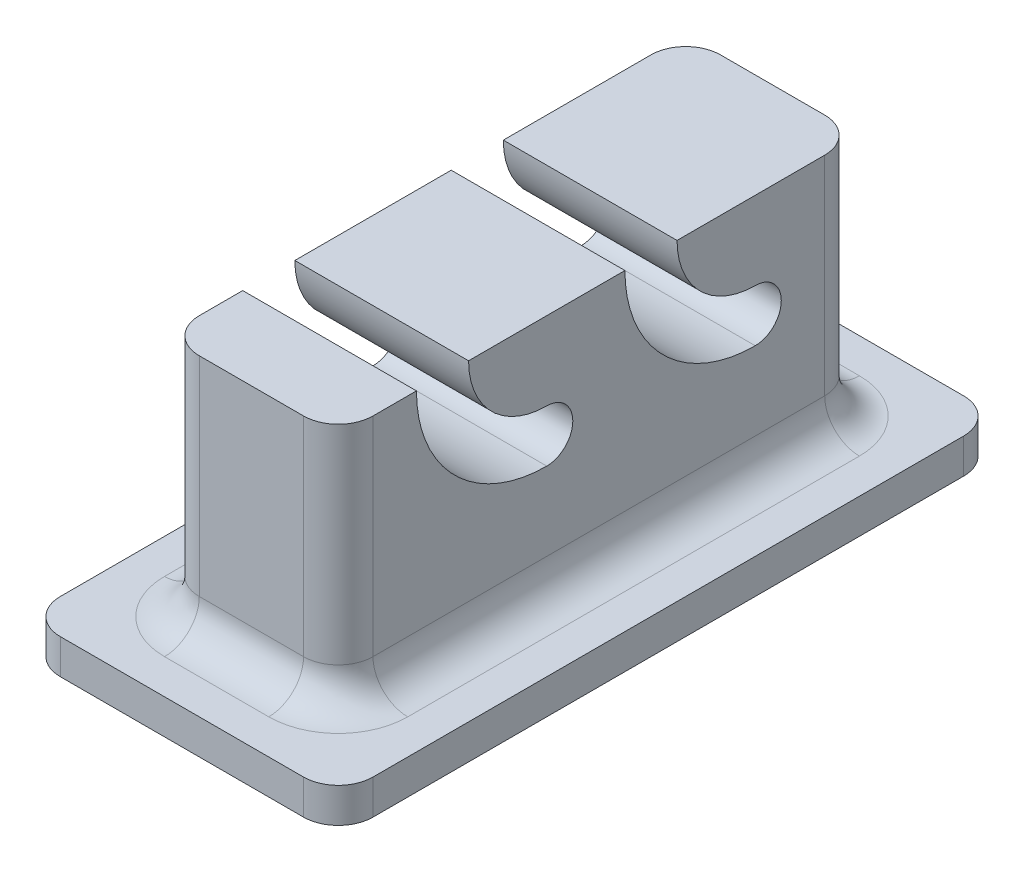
from build123d import *

# Parameters (mm, degrees)
SKETCH1_W           = 10
SKETCH1_H           = 30
BOSS_EXTRUDE1_DEPTH = 16
SKETCH3_W           = 18
SKETCH3_H           = 38
BOSS_EXTRUDE2_DEPTH = 2
SKETCH4_R           = 1.5
CUT_EXTRUDE1_DEPTH  = 10
FILLET1_R           = 2


with BuildPart() as part:
    # Sketch1 → Boss-Extrude1 (new body)
    with BuildSketch(Plane(origin=(0, 0, 0), x_dir=(1, 0, 0), z_dir=(0, 1, 0))):
        with Locations((5, 15)):
            Rectangle(SKETCH1_W, SKETCH1_H)
    extrude(amount=BOSS_EXTRUDE1_DEPTH)

    # Sketch3 → Boss-Extrude2 (add)
    with BuildSketch(Plane.XZ):
        with Locations((5, -15)):
            Rectangle(SKETCH3_W, SKETCH3_H)
    extrude(amount=-BOSS_EXTRUDE2_DEPTH)

    # Sketch4 → Cut-Extrude1 (cut)
    with BuildSketch(Plane(origin=(10, 0, 0), x_dir=(0, 0, -1), z_dir=(1, 0, 0))):
        with BuildLine():
            Line((7.5, 16), (4.5, 16))
            ThreePointArc((4.5, 16), (6.696699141, 10.696699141), (12, 8.5))
            ThreePointArc((12, 8.5), (10.5, 10), (12, 11.5))
            ThreePointArc((12, 11.5), (8.818019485, 12.818019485), (7.5, 16))
        make_face()
        with BuildLine():
            Line((19.5, 16), (16.5, 16))
            ThreePointArc((16.5, 16), (18.696699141, 10.696699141), (24, 8.5))
            ThreePointArc((24, 8.5), (22.5, 10), (24, 11.5))
            ThreePointArc((24, 11.5), (20.818019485, 12.818019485), (19.5, 16))
        make_face()
        with Locations((24, 10)):
            Circle(SKETCH4_R)
        with Locations((12, 10)):
            Circle(SKETCH4_R)
    extrude(amount=-CUT_EXTRUDE1_DEPTH, mode=Mode.SUBTRACT)

    # Fillet1
    fillet1_edges = [part.edges().sort_by_distance(p)[0] for p in [
        (5, 2, -30),
        (5, 2, 0),
        (0, 2, -15),
        (10, 2, -15),
        (-4, 1, 4),
        (14, 1, 4),
        (14, 1, -34),
        (-4, 1, -34),
        (0, 9, -30),
        (10, 9, -30),
        (10, 9, 0),
        (0, 9, 0),
    ]]
    fillet(fillet1_edges, radius=FILLET1_R)


solid = part.part
